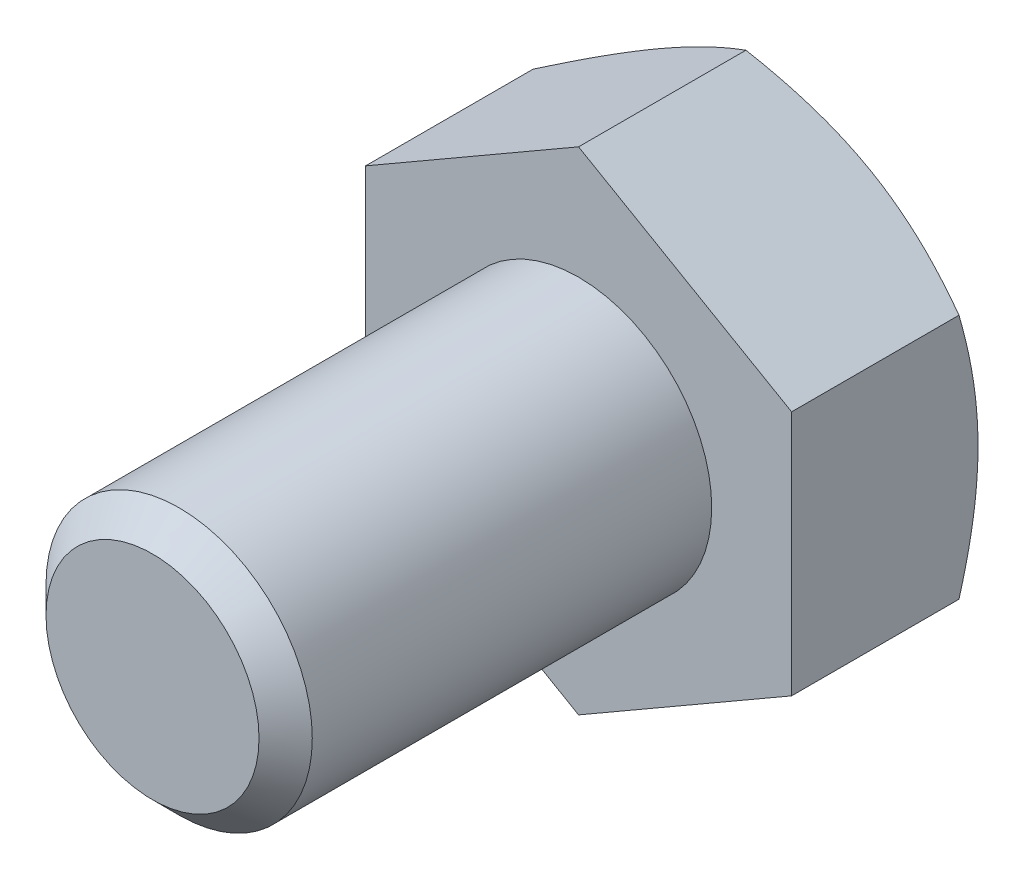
ISO-10303-21;
HEADER;
FILE_DESCRIPTION(('STEP AP214'),'2;1');
FILE_NAME('part.step','',(''),(''),'','','');
FILE_SCHEMA(('AUTOMOTIVE_DESIGN { 1 0 10303 214 1 1 1 1 }'));
ENDSEC;
DATA;
#1=APPLICATION_CONTEXT('core data for automotive mechanical design processes');
#2=APPLICATION_PROTOCOL_DEFINITION('international standard','automotive_design',2000,#1);
#3=PRODUCT_CONTEXT('',#1,'mechanical');
#4=PRODUCT('Part','Part','',(#3));
#5=PRODUCT_RELATED_PRODUCT_CATEGORY('part','',(#4));
#6=PRODUCT_DEFINITION_FORMATION('','',#4);
#7=PRODUCT_DEFINITION_CONTEXT('part definition',#1,'design');
#8=PRODUCT_DEFINITION('design','',#6,#7);
#9=PRODUCT_DEFINITION_SHAPE('','',#8);
#10=(LENGTH_UNIT() NAMED_UNIT(*) SI_UNIT(.MILLI.,.METRE.));
#11=(NAMED_UNIT(*) PLANE_ANGLE_UNIT() SI_UNIT($,.RADIAN.));
#12=(NAMED_UNIT(*) SI_UNIT($,.STERADIAN.) SOLID_ANGLE_UNIT());
#13=UNCERTAINTY_MEASURE_WITH_UNIT(LENGTH_MEASURE(1.E-05),#10,'distance_accuracy_value','');
#14=(GEOMETRIC_REPRESENTATION_CONTEXT(3) GLOBAL_UNCERTAINTY_ASSIGNED_CONTEXT((#13)) GLOBAL_UNIT_ASSIGNED_CONTEXT((#10,
#11,#12)) REPRESENTATION_CONTEXT('',''));
#15=CARTESIAN_POINT('',(0.,0.,0.));
#16=DIRECTION('',(0.,0.,1.));
#17=DIRECTION('',(1.,0.,0.));
#18=AXIS2_PLACEMENT_3D('',#15,#16,#17);
#19=CARTESIAN_POINT('',(0.,0.,8.));
#20=DIRECTION('',(0.,0.,1.));
#21=DIRECTION('',(1.,0.,0.));
#22=AXIS2_PLACEMENT_3D('',#19,#20,#21);
#23=PLANE('',#22);
#24=CARTESIAN_POINT('',(0.,0.,8.));
#25=DIRECTION('',(0.,0.,1.));
#26=DIRECTION('',(1.,0.,0.));
#27=AXIS2_PLACEMENT_3D('',#24,#25,#26);
#28=CIRCLE('',#27,2.);
#29=CARTESIAN_POINT('',(2.,0.,8.));
#30=VERTEX_POINT('',#29);
#31=EDGE_CURVE('E542',#30,#30,#28,.T.);
#32=ORIENTED_EDGE('',*,*,#31,.T.);
#33=EDGE_LOOP('',(#32));
#34=FACE_BOUND('',#33,.T.);
#35=ADVANCED_FACE('F368',(#34),#23,.T.);
#36=CARTESIAN_POINT('',(0.,0.,0.));
#37=DIRECTION('',(0.,0.,1.));
#38=DIRECTION('',(1.,0.,0.));
#39=AXIS2_PLACEMENT_3D('',#36,#37,#38);
#40=CYLINDRICAL_SURFACE('',#39,2.5);
#41=CARTESIAN_POINT('',(0.,0.,7.5));
#42=DIRECTION('',(0.,0.,1.));
#43=DIRECTION('',(1.,0.,0.));
#44=AXIS2_PLACEMENT_3D('',#41,#42,#43);
#45=CIRCLE('',#44,2.5);
#46=CARTESIAN_POINT('',(2.5,0.,7.5));
#47=VERTEX_POINT('',#46);
#48=EDGE_CURVE('E544',#47,#47,#45,.F.);
#49=ORIENTED_EDGE('',*,*,#48,.T.);
#50=EDGE_LOOP('',(#49));
#51=FACE_BOUND('',#50,.T.);
#52=CARTESIAN_POINT('',(0.,0.,0.));
#53=DIRECTION('',(0.,0.,1.));
#54=DIRECTION('',(1.,0.,0.));
#55=AXIS2_PLACEMENT_3D('',#52,#53,#54);
#56=CIRCLE('',#55,2.5);
#57=CARTESIAN_POINT('',(2.5,0.,0.));
#58=VERTEX_POINT('',#57);
#59=EDGE_CURVE('E545',#58,#58,#56,.F.);
#60=ORIENTED_EDGE('',*,*,#59,.F.);
#61=EDGE_LOOP('',(#60));
#62=FACE_BOUND('',#61,.T.);
#63=ADVANCED_FACE('F533',(#51,#62),#40,.T.);
#64=CARTESIAN_POINT('',(0.,0.,8.));
#65=DIRECTION('',(0.,0.,-1.));
#66=DIRECTION('',(-1.,0.,0.));
#67=AXIS2_PLACEMENT_3D('',#64,#65,#66);
#68=CONICAL_SURFACE('',#67,2.,0.785398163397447);
#69=ORIENTED_EDGE('',*,*,#48,.F.);
#70=EDGE_LOOP('',(#69));
#71=FACE_BOUND('',#70,.T.);
#72=ORIENTED_EDGE('',*,*,#31,.F.);
#73=EDGE_LOOP('',(#72));
#74=FACE_BOUND('',#73,.T.);
#75=ADVANCED_FACE('F538',(#71,#74),#68,.T.);
#76=CARTESIAN_POINT('',(0.,4.61880215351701,-3.5));
#77=DIRECTION('',(0.499999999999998,0.86602540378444,0.));
#78=DIRECTION('',(-0.86602540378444,0.499999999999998,0.));
#79=AXIS2_PLACEMENT_3D('',#76,#77,#78);
#80=PLANE('',#79);
#81=CARTESIAN_POINT('',(-0.000200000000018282,4.61891762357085,-3.14266774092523));
#82=CARTESIAN_POINT('',(0.17557915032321,4.51743148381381,-3.20128212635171));
#83=CARTESIAN_POINT('',(0.352875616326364,4.41506932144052,-3.25458967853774));
#84=CARTESIAN_POINT('',(0.710538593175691,4.2085725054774,-3.3476383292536));
#85=CARTESIAN_POINT('',(0.890911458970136,4.10443418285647,-3.3873465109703));
#86=CARTESIAN_POINT('',(1.24942181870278,3.89744813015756,-3.44915778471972));
#87=CARTESIAN_POINT('',(1.42750415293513,3.7946322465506,-3.47167226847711));
#88=CARTESIAN_POINT('',(1.7845067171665,3.58851671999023,-3.49854937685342));
#89=CARTESIAN_POINT('',(1.96342564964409,3.48521782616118,-3.50293425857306));
#90=CARTESIAN_POINT('',(2.29774284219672,3.29219970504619,-3.49380992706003));
#91=CARTESIAN_POINT('',(2.45319115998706,3.20245157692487,-3.48254104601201));
#92=CARTESIAN_POINT('',(2.76307505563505,3.02354002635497,-3.44682600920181));
#93=CARTESIAN_POINT('',(2.91750956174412,2.93437722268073,-3.42236765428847));
#94=CARTESIAN_POINT('',(3.22803232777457,2.75509682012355,-3.36122393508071));
#95=CARTESIAN_POINT('',(3.3840812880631,2.66500191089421,-3.32427939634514));
#96=CARTESIAN_POINT('',(3.69385183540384,2.48615580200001,-3.24042992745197));
#97=CARTESIAN_POINT('',(3.84757739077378,2.39740231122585,-3.19354469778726));
#98=CARTESIAN_POINT('',(4.0002,2.30928560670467,-3.14266774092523));
#99=B_SPLINE_CURVE_WITH_KNOTS('',3,(#81,#82,#83,#84,#85,#86,#87,#88,#89,#90,#91,#92,#93,#94,#95,
#96,#97,#98),.UNSPECIFIED.,.F.,.F.,(4,2,2,2,2,2,2,2,4),(0.,0.634047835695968,1.26961969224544,
1.88946157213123,2.50854226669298,3.04757825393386,3.58711366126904,4.13861653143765,
4.68903648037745),.UNSPECIFIED.);
#100=CARTESIAN_POINT('',(0.,4.61880215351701,-3.14273441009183));
#101=VERTEX_POINT('',#100);
#102=CARTESIAN_POINT('',(1.99999999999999,3.46410161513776,-3.5));
#103=VERTEX_POINT('',#102);
#104=EDGE_CURVE('E578',#101,#103,#99,.T.);
#105=ORIENTED_EDGE('',*,*,#104,.F.);
#106=DIRECTION('',(0.,0.,1.));
#107=VECTOR('',#106,1.);
#108=CARTESIAN_POINT('',(0.,4.61880215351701,-3.5));
#109=LINE('',#108,#107);
#110=CARTESIAN_POINT('',(0.,4.61880215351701,0.));
#111=VERTEX_POINT('',#110);
#112=EDGE_CURVE('E552',#101,#111,#109,.T.);
#113=ORIENTED_EDGE('',*,*,#112,.T.);
#114=DIRECTION('',(-0.86602540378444,0.499999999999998,0.));
#115=VECTOR('',#114,1.);
#116=CARTESIAN_POINT('',(0.,4.61880215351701,0.));
#117=LINE('',#116,#115);
#118=CARTESIAN_POINT('',(4.,2.30940107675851,0.));
#119=VERTEX_POINT('',#118);
#120=EDGE_CURVE('E576',#119,#111,#117,.T.);
#121=ORIENTED_EDGE('',*,*,#120,.F.);
#122=DIRECTION('',(0.,0.,1.));
#123=VECTOR('',#122,1.);
#124=CARTESIAN_POINT('',(4.,2.30940107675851,-3.5));
#125=LINE('',#124,#123);
#126=CARTESIAN_POINT('',(4.,2.30940107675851,-3.14273441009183));
#127=VERTEX_POINT('',#126);
#128=EDGE_CURVE('E549',#127,#119,#125,.T.);
#129=ORIENTED_EDGE('',*,*,#128,.F.);
#130=EDGE_CURVE('E508',#103,#127,#99,.T.);
#131=ORIENTED_EDGE('',*,*,#130,.F.);
#132=EDGE_LOOP('',(#105,#113,#121,#129,#131));
#133=FACE_BOUND('',#132,.T.);
#134=ADVANCED_FACE('F518',(#133),#80,.T.);
#135=CARTESIAN_POINT('',(4.,-2.30940107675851,-3.5));
#136=DIRECTION('',(1.,0.,0.));
#137=DIRECTION('',(0.,0.,-1.));
#138=AXIS2_PLACEMENT_3D('',#135,#136,#137);
#139=PLANE('',#138);
#140=CARTESIAN_POINT('',(4.,-6.3201620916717,-1.49105074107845));
#141=CARTESIAN_POINT('',(4.,-6.14442149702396,-1.57676392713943));
#142=CARTESIAN_POINT('',(4.,-5.96828976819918,-1.66168830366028));
#143=CARTESIAN_POINT('',(4.,-5.61503642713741,-1.82951794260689));
#144=CARTESIAN_POINT('',(4.,-5.43791467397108,-1.91242290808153));
#145=CARTESIAN_POINT('',(4.,-5.08161610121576,-2.07616457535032));
#146=CARTESIAN_POINT('',(4.,-4.90243340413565,-2.15698853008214));
#147=CARTESIAN_POINT('',(4.,-4.54268290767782,-2.31548071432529));
#148=CARTESIAN_POINT('',(4.,-4.36211517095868,-2.3931490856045));
#149=CARTESIAN_POINT('',(4.,-3.99309046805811,-2.54709429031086));
#150=CARTESIAN_POINT('',(4.,-3.80457523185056,-2.62323217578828));
#151=CARTESIAN_POINT('',(4.,-3.42538286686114,-2.77002330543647));
#152=CARTESIAN_POINT('',(4.,-3.23470550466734,-2.84067595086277));
#153=CARTESIAN_POINT('',(4.,-2.85120603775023,-2.9747272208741));
#154=CARTESIAN_POINT('',(4.,-2.65838877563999,-3.03813956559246));
#155=CARTESIAN_POINT('',(4.,-2.26999073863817,-3.15575322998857));
#156=CARTESIAN_POINT('',(4.,-2.07441081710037,-3.2099573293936));
#157=CARTESIAN_POINT('',(4.,-1.68146389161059,-3.30634238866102));
#158=CARTESIAN_POINT('',(4.,-1.48411388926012,-3.34859141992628));
#159=CARTESIAN_POINT('',(4.,-1.08684206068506,-3.41875684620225));
#160=CARTESIAN_POINT('',(4.,-0.886920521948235,-3.44667482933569));
#161=CARTESIAN_POINT('',(4.,-0.488161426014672,-3.48559194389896));
#162=CARTESIAN_POINT('',(4.,-0.289346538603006,-3.49681761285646));
#163=CARTESIAN_POINT('',(4.,0.108530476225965,-3.5020027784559));
#164=CARTESIAN_POINT('',(4.,0.307592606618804,-3.49596206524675));
#165=CARTESIAN_POINT('',(4.,0.642130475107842,-3.47173841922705));
#166=CARTESIAN_POINT('',(4.,0.777947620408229,-3.45796321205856));
#167=CARTESIAN_POINT('',(4.,1.04865722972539,-3.42317125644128));
#168=CARTESIAN_POINT('',(4.,1.18354957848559,-3.4021536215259));
#169=CARTESIAN_POINT('',(4.,1.58661718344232,-3.32933470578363));
#170=CARTESIAN_POINT('',(4.,1.85305348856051,-3.2677780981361));
#171=CARTESIAN_POINT('',(4.,2.25169312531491,-3.16013293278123));
#172=CARTESIAN_POINT('',(4.,2.38593642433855,-3.12116080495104));
#173=CARTESIAN_POINT('',(4.,2.65312122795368,-3.03894486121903));
#174=CARTESIAN_POINT('',(4.,2.78606272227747,-2.99570101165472));
#175=CARTESIAN_POINT('',(4.,3.05068341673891,-2.90565399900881));
#176=CARTESIAN_POINT('',(4.,3.18236294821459,-2.8588518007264));
#177=CARTESIAN_POINT('',(4.,3.44461473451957,-2.76226098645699));
#178=CARTESIAN_POINT('',(4.,3.57518701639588,-2.71247244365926));
#179=CARTESIAN_POINT('',(4.,3.93177798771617,-2.57257226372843));
#180=CARTESIAN_POINT('',(4.,4.15680215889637,-2.47992787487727));
#181=CARTESIAN_POINT('',(4.,4.60447894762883,-2.28905562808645));
#182=CARTESIAN_POINT('',(4.,4.82713127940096,-2.19082710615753));
#183=CARTESIAN_POINT('',(4.,5.27061186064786,-1.99013448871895));
#184=CARTESIAN_POINT('',(4.,5.49143940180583,-1.88766883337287));
#185=CARTESIAN_POINT('',(4.,5.93157734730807,-1.67952247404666));
#186=CARTESIAN_POINT('',(4.,6.15088770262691,-1.57384166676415));
#187=CARTESIAN_POINT('',(4.,6.58864452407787,-1.35980684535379));
#188=CARTESIAN_POINT('',(4.,6.80708897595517,-1.25144872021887));
#189=CARTESIAN_POINT('',(4.,7.24298360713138,-1.03274864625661));
#190=CARTESIAN_POINT('',(4.,7.46043377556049,-0.922406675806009));
#191=CARTESIAN_POINT('',(4.,8.11147090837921,-0.589073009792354));
#192=CARTESIAN_POINT('',(4.,8.5438492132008,-0.363721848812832));
#193=CARTESIAN_POINT('',(4.,9.35956992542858,0.0664624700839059));
#194=CARTESIAN_POINT('',(4.,9.74313951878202,0.270866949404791));
#195=CARTESIAN_POINT('',(4.,10.5090013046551,0.68211422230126));
#196=CARTESIAN_POINT('',(4.,10.891293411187,0.888957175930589));
#197=CARTESIAN_POINT('',(4.,11.6535663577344,1.30371780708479));
#198=CARTESIAN_POINT('',(4.,12.0335506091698,1.51162922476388));
#199=CARTESIAN_POINT('',(4.,12.7927224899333,1.928827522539));
#200=CARTESIAN_POINT('',(4.,13.1719101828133,2.13811428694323));
#201=CARTESIAN_POINT('',(4.,13.5508195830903,2.34790058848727));
#202=B_SPLINE_CURVE_WITH_KNOTS('',3,(#140,#141,#142,#143,#144,#145,#146,#147,#148,#149,#150,
#151,#152,#153,#154,#155,#156,#157,#158,#159,#160,#161,#162,#163,#164,#165,#166,#167,#168,#169,
#170,#171,#172,#173,#174,#175,#176,#177,#178,#179,#180,#181,#182,#183,#184,#185,#186,#187,#188,
#189,#190,#191,#192,#193,#194,#195,#196,#197,#198,#199,#200,#201),.UNSPECIFIED.,.F.,.F.,(4,2,2,
2,2,2,2,2,2,2,2,2,2,2,2,2,2,2,2,2,2,2,2,2,2,2,2,2,2,2,4),(0.,0.58659299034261,1.17327172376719,
1.76295108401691,2.35260392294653,2.96246799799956,3.57239854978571,4.18115341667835,
4.78972418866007,5.39475667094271,5.99972209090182,6.59639988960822,7.19308494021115,
7.60243041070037,8.01182600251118,8.83100524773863,9.25032401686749,9.66964609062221,
10.0888548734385,10.5080533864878,11.2379871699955,11.9680079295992,12.6982998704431,
13.4286153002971,14.1601319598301,14.8916565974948,16.354355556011,17.6582490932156,
18.9622286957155,20.261662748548,21.5609888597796),.UNSPECIFIED.);
#203=CARTESIAN_POINT('',(4.,0.,-3.5));
#204=VERTEX_POINT('',#203);
#205=EDGE_CURVE('E506',#127,#204,#202,.F.);
#206=ORIENTED_EDGE('',*,*,#205,.F.);
#207=ORIENTED_EDGE('',*,*,#128,.T.);
#208=DIRECTION('',(0.,1.,0.));
#209=VECTOR('',#208,1.);
#210=CARTESIAN_POINT('',(4.,-2.30940107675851,0.));
#211=LINE('',#210,#209);
#212=CARTESIAN_POINT('',(4.,-2.30940107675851,0.));
#213=VERTEX_POINT('',#212);
#214=EDGE_CURVE('E554',#213,#119,#211,.T.);
#215=ORIENTED_EDGE('',*,*,#214,.F.);
#216=DIRECTION('',(0.,0.,1.));
#217=VECTOR('',#216,1.);
#218=CARTESIAN_POINT('',(4.,-2.30940107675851,-3.5));
#219=LINE('',#218,#217);
#220=CARTESIAN_POINT('',(4.,-2.30940107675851,-3.14273441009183));
#221=VERTEX_POINT('',#220);
#222=EDGE_CURVE('E560',#221,#213,#219,.T.);
#223=ORIENTED_EDGE('',*,*,#222,.F.);
#224=EDGE_CURVE('E501',#204,#221,#202,.F.);
#225=ORIENTED_EDGE('',*,*,#224,.F.);
#226=EDGE_LOOP('',(#206,#207,#215,#223,#225));
#227=FACE_BOUND('',#226,.T.);
#228=ADVANCED_FACE('F514',(#227),#139,.T.);
#229=CARTESIAN_POINT('',(0.,-4.61880215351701,-3.5));
#230=DIRECTION('',(0.499999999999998,-0.86602540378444,0.));
#231=DIRECTION('',(0.86602540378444,0.499999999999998,0.));
#232=AXIS2_PLACEMENT_3D('',#229,#230,#231);
#233=PLANE('',#232);
#234=CARTESIAN_POINT('',(4.0002,-2.30928560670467,-3.14266774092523));
#235=CARTESIAN_POINT('',(3.82442084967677,-2.41077174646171,-3.20128212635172));
#236=CARTESIAN_POINT('',(3.64712438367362,-2.513133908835,-3.25458967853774));
#237=CARTESIAN_POINT('',(3.28946140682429,-2.71963072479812,-3.3476383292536));
#238=CARTESIAN_POINT('',(3.10908854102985,-2.82376904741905,-3.3873465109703));
#239=CARTESIAN_POINT('',(2.75057818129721,-3.03075510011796,-3.44915778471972));
#240=CARTESIAN_POINT('',(2.57249584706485,-3.13357098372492,-3.47167226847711));
#241=CARTESIAN_POINT('',(2.21549328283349,-3.33968651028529,-3.49854937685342));
#242=CARTESIAN_POINT('',(2.03657435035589,-3.44298540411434,-3.50293425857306));
#243=CARTESIAN_POINT('',(1.70225715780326,-3.63600352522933,-3.49380992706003));
#244=CARTESIAN_POINT('',(1.54680884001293,-3.72575165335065,-3.48254104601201));
#245=CARTESIAN_POINT('',(1.23692494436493,-3.90466320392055,-3.44682600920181));
#246=CARTESIAN_POINT('',(1.08249043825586,-3.99382600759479,-3.42236765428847));
#247=CARTESIAN_POINT('',(0.771967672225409,-4.17310641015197,-3.36122393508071));
#248=CARTESIAN_POINT('',(0.615918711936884,-4.26320131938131,-3.32427939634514));
#249=CARTESIAN_POINT('',(0.306148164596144,-4.44204742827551,-3.24042992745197));
#250=CARTESIAN_POINT('',(0.152422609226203,-4.53080091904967,-3.19354469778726));
#251=CARTESIAN_POINT('',(-0.000200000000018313,-4.61891762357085,-3.14266774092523));
#252=B_SPLINE_CURVE_WITH_KNOTS('',3,(#234,#235,#236,#237,#238,#239,#240,#241,#242,#243,#244,
#245,#246,#247,#248,#249,#250,#251),.UNSPECIFIED.,.F.,.F.,(4,2,2,2,2,2,2,2,4),(0.,
0.634047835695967,1.26961969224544,1.88946157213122,2.50854226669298,3.04757825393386,
3.58711366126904,4.13861653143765,4.68903648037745),.UNSPECIFIED.);
#253=CARTESIAN_POINT('',(1.99999999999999,-3.46410161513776,-3.5));
#254=VERTEX_POINT('',#253);
#255=EDGE_CURVE('E507',#221,#254,#252,.T.);
#256=ORIENTED_EDGE('',*,*,#255,.F.);
#257=ORIENTED_EDGE('',*,*,#222,.T.);
#258=DIRECTION('',(0.86602540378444,0.499999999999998,0.));
#259=VECTOR('',#258,1.);
#260=CARTESIAN_POINT('',(0.,-4.61880215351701,0.));
#261=LINE('',#260,#259);
#262=CARTESIAN_POINT('',(0.,-4.61880215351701,0.));
#263=VERTEX_POINT('',#262);
#264=EDGE_CURVE('E565',#263,#213,#261,.T.);
#265=ORIENTED_EDGE('',*,*,#264,.F.);
#266=DIRECTION('',(0.,0.,1.));
#267=VECTOR('',#266,1.);
#268=CARTESIAN_POINT('',(0.,-4.61880215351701,-3.5));
#269=LINE('',#268,#267);
#270=CARTESIAN_POINT('',(0.,-4.61880215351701,-3.14273441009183));
#271=VERTEX_POINT('',#270);
#272=EDGE_CURVE('E558',#271,#263,#269,.T.);
#273=ORIENTED_EDGE('',*,*,#272,.F.);
#274=EDGE_CURVE('E495',#254,#271,#252,.T.);
#275=ORIENTED_EDGE('',*,*,#274,.F.);
#276=EDGE_LOOP('',(#256,#257,#265,#273,#275));
#277=FACE_BOUND('',#276,.T.);
#278=ADVANCED_FACE('F517',(#277),#233,.T.);
#279=CARTESIAN_POINT('',(0.,-4.61880215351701,-3.5));
#280=DIRECTION('',(-0.500000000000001,-0.866025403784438,0.));
#281=DIRECTION('',(0.866025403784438,-0.500000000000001,0.));
#282=AXIS2_PLACEMENT_3D('',#279,#280,#281);
#283=PLANE('',#282);
#284=CARTESIAN_POINT('',(0.000199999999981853,-4.61891762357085,-3.14266774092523));
#285=CARTESIAN_POINT('',(-0.175579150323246,-4.51743148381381,-3.20128212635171));
#286=CARTESIAN_POINT('',(-0.352875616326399,-4.41506932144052,-3.25458967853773));
#287=CARTESIAN_POINT('',(-0.710538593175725,-4.2085725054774,-3.34763832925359));
#288=CARTESIAN_POINT('',(-0.89091145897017,-4.10443418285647,-3.38734651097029));
#289=CARTESIAN_POINT('',(-1.24942181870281,-3.89744813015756,-3.44915778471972));
#290=CARTESIAN_POINT('',(-1.42750415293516,-3.79463224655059,-3.47167226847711));
#291=CARTESIAN_POINT('',(-1.78450671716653,-3.58851671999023,-3.49854937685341));
#292=CARTESIAN_POINT('',(-1.96342564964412,-3.48521782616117,-3.50293425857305));
#293=CARTESIAN_POINT('',(-2.29774284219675,-3.29219970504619,-3.49380992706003));
#294=CARTESIAN_POINT('',(-2.45319115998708,-3.20245157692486,-3.482541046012));
#295=CARTESIAN_POINT('',(-2.76307505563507,-3.02354002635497,-3.4468260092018));
#296=CARTESIAN_POINT('',(-2.91750956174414,-2.93437722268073,-3.42236765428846));
#297=CARTESIAN_POINT('',(-3.22803232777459,-2.75509682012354,-3.36122393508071));
#298=CARTESIAN_POINT('',(-3.38408128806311,-2.6650019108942,-3.32427939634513));
#299=CARTESIAN_POINT('',(-3.69385183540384,-2.48615580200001,-3.24042992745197));
#300=CARTESIAN_POINT('',(-3.84757739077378,-2.39740231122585,-3.19354469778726));
#301=CARTESIAN_POINT('',(-4.0002,-2.30928560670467,-3.14266774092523));
#302=B_SPLINE_CURVE_WITH_KNOTS('',3,(#284,#285,#286,#287,#288,#289,#290,#291,#292,#293,#294,
#295,#296,#297,#298,#299,#300,#301),.UNSPECIFIED.,.F.,.F.,(4,2,2,2,2,2,2,2,4),(0.,
0.634047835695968,1.26961969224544,1.88946157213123,2.50854226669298,3.04757825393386,
3.58711366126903,4.13861653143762,4.68903648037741),.UNSPECIFIED.);
#303=CARTESIAN_POINT('',(-2.,-3.46410161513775,-3.5));
#304=VERTEX_POINT('',#303);
#305=EDGE_CURVE('E597',#271,#304,#302,.T.);
#306=ORIENTED_EDGE('',*,*,#305,.F.);
#307=ORIENTED_EDGE('',*,*,#272,.T.);
#308=DIRECTION('',(0.866025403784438,-0.500000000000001,0.));
#309=VECTOR('',#308,1.);
#310=CARTESIAN_POINT('',(0.,-4.61880215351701,0.));
#311=LINE('',#310,#309);
#312=CARTESIAN_POINT('',(-4.,-2.30940107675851,0.));
#313=VERTEX_POINT('',#312);
#314=EDGE_CURVE('E568',#313,#263,#311,.T.);
#315=ORIENTED_EDGE('',*,*,#314,.F.);
#316=DIRECTION('',(0.,0.,1.));
#317=VECTOR('',#316,1.);
#318=CARTESIAN_POINT('',(-4.,-2.30940107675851,-3.5));
#319=LINE('',#318,#317);
#320=CARTESIAN_POINT('',(-4.,-2.30940107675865,-3.14273441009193));
#321=VERTEX_POINT('',#320);
#322=EDGE_CURVE('E556',#321,#313,#319,.T.);
#323=ORIENTED_EDGE('',*,*,#322,.F.);
#324=EDGE_CURVE('E444',#304,#321,#302,.T.);
#325=ORIENTED_EDGE('',*,*,#324,.F.);
#326=EDGE_LOOP('',(#306,#307,#315,#323,#325));
#327=FACE_BOUND('',#326,.T.);
#328=ADVANCED_FACE('F522',(#327),#283,.T.);
#329=CARTESIAN_POINT('',(-4.,-2.30940107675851,-3.5));
#330=DIRECTION('',(-1.,0.,0.));
#331=DIRECTION('',(0.,0.,1.));
#332=AXIS2_PLACEMENT_3D('',#329,#330,#331);
#333=PLANE('',#332);
#334=CARTESIAN_POINT('',(-4.,-6.3201620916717,-1.49105074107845));
#335=CARTESIAN_POINT('',(-4.,-6.14442149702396,-1.57676392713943));
#336=CARTESIAN_POINT('',(-4.,-5.96828976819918,-1.66168830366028));
#337=CARTESIAN_POINT('',(-4.,-5.61503642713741,-1.82951794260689));
#338=CARTESIAN_POINT('',(-4.,-5.43791467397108,-1.91242290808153));
#339=CARTESIAN_POINT('',(-4.,-5.08161610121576,-2.07616457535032));
#340=CARTESIAN_POINT('',(-4.,-4.90243340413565,-2.15698853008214));
#341=CARTESIAN_POINT('',(-4.,-4.54268290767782,-2.31548071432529));
#342=CARTESIAN_POINT('',(-4.,-4.36211517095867,-2.3931490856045));
#343=CARTESIAN_POINT('',(-4.,-3.99309046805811,-2.54709429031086));
#344=CARTESIAN_POINT('',(-4.,-3.80457523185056,-2.62323217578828));
#345=CARTESIAN_POINT('',(-4.,-3.42538286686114,-2.77002330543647));
#346=CARTESIAN_POINT('',(-4.,-3.23470550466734,-2.84067595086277));
#347=CARTESIAN_POINT('',(-4.,-2.85120603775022,-2.9747272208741));
#348=CARTESIAN_POINT('',(-4.,-2.65838877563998,-3.03813956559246));
#349=CARTESIAN_POINT('',(-4.,-2.26999073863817,-3.15575322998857));
#350=CARTESIAN_POINT('',(-4.,-2.07441081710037,-3.2099573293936));
#351=CARTESIAN_POINT('',(-4.,-1.68146389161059,-3.30634238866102));
#352=CARTESIAN_POINT('',(-4.,-1.48411388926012,-3.34859141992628));
#353=CARTESIAN_POINT('',(-4.,-1.08684206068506,-3.41875684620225));
#354=CARTESIAN_POINT('',(-4.,-0.886920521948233,-3.44667482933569));
#355=CARTESIAN_POINT('',(-4.,-0.488161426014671,-3.48559194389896));
#356=CARTESIAN_POINT('',(-4.,-0.289346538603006,-3.49681761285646));
#357=CARTESIAN_POINT('',(-4.,0.108530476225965,-3.5020027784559));
#358=CARTESIAN_POINT('',(-4.,0.307592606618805,-3.49596206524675));
#359=CARTESIAN_POINT('',(-4.,0.642130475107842,-3.47173841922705));
#360=CARTESIAN_POINT('',(-4.,0.777947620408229,-3.45796321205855));
#361=CARTESIAN_POINT('',(-4.,1.04865722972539,-3.42317125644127));
#362=CARTESIAN_POINT('',(-4.,1.18354957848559,-3.4021536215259));
#363=CARTESIAN_POINT('',(-4.,1.58661718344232,-3.32933470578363));
#364=CARTESIAN_POINT('',(-4.,1.8530534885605,-3.2677780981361));
#365=CARTESIAN_POINT('',(-4.,2.2516931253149,-3.16013293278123));
#366=CARTESIAN_POINT('',(-4.,2.38593642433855,-3.12116080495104));
#367=CARTESIAN_POINT('',(-4.,2.65312122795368,-3.03894486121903));
#368=CARTESIAN_POINT('',(-4.,2.78606272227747,-2.99570101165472));
#369=CARTESIAN_POINT('',(-4.,3.05068341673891,-2.90565399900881));
#370=CARTESIAN_POINT('',(-4.,3.18236294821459,-2.8588518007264));
#371=CARTESIAN_POINT('',(-4.,3.44461473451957,-2.76226098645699));
#372=CARTESIAN_POINT('',(-4.,3.57518701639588,-2.71247244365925));
#373=CARTESIAN_POINT('',(-4.,3.93177798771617,-2.57257226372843));
#374=CARTESIAN_POINT('',(-4.,4.15680215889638,-2.47992787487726));
#375=CARTESIAN_POINT('',(-4.,4.60447894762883,-2.28905562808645));
#376=CARTESIAN_POINT('',(-4.,4.82713127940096,-2.19082710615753));
#377=CARTESIAN_POINT('',(-4.,5.27061186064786,-1.99013448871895));
#378=CARTESIAN_POINT('',(-4.,5.49143940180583,-1.88766883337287));
#379=CARTESIAN_POINT('',(-4.,5.93157734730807,-1.67952247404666));
#380=CARTESIAN_POINT('',(-4.,6.15088770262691,-1.57384166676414));
#381=CARTESIAN_POINT('',(-4.,6.58864452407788,-1.35980684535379));
#382=CARTESIAN_POINT('',(-4.,6.80708897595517,-1.25144872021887));
#383=CARTESIAN_POINT('',(-4.,7.24298360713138,-1.03274864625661));
#384=CARTESIAN_POINT('',(-4.,7.46043377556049,-0.922406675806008));
#385=CARTESIAN_POINT('',(-4.,8.11147090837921,-0.589073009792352));
#386=CARTESIAN_POINT('',(-4.,8.5438492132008,-0.363721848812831));
#387=CARTESIAN_POINT('',(-4.,9.35956992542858,0.066462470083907));
#388=CARTESIAN_POINT('',(-4.,9.74313951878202,0.270866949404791));
#389=CARTESIAN_POINT('',(-4.,10.5090013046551,0.68211422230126));
#390=CARTESIAN_POINT('',(-4.,10.891293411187,0.888957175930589));
#391=CARTESIAN_POINT('',(-4.,11.6535663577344,1.30371780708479));
#392=CARTESIAN_POINT('',(-4.,12.0335506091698,1.51162922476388));
#393=CARTESIAN_POINT('',(-4.,12.7927224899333,1.928827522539));
#394=CARTESIAN_POINT('',(-4.,13.1719101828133,2.13811428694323));
#395=CARTESIAN_POINT('',(-4.,13.5508195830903,2.34790058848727));
#396=B_SPLINE_CURVE_WITH_KNOTS('',3,(#334,#335,#336,#337,#338,#339,#340,#341,#342,#343,#344,
#345,#346,#347,#348,#349,#350,#351,#352,#353,#354,#355,#356,#357,#358,#359,#360,#361,#362,#363,
#364,#365,#366,#367,#368,#369,#370,#371,#372,#373,#374,#375,#376,#377,#378,#379,#380,#381,#382,
#383,#384,#385,#386,#387,#388,#389,#390,#391,#392,#393,#394,#395),.UNSPECIFIED.,.F.,.F.,(4,2,2,
2,2,2,2,2,2,2,2,2,2,2,2,2,2,2,2,2,2,2,2,2,2,2,2,2,2,2,4),(0.,0.586592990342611,1.17327172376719,
1.76295108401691,2.35260392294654,2.96246799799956,3.57239854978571,4.18115341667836,
4.78972418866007,5.39475667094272,5.99972209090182,6.59639988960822,7.19308494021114,
7.60243041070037,8.01182600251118,8.83100524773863,9.25032401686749,9.66964609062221,
10.0888548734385,10.5080533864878,11.2379871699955,11.9680079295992,12.6982998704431,
13.4286153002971,14.1601319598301,14.8916565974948,16.354355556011,17.6582490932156,
18.9622286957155,20.261662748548,21.5609888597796),.UNSPECIFIED.);
#397=CARTESIAN_POINT('',(-4.,0.,-3.5));
#398=VERTEX_POINT('',#397);
#399=EDGE_CURVE('E439',#321,#398,#396,.T.);
#400=ORIENTED_EDGE('',*,*,#399,.F.);
#401=ORIENTED_EDGE('',*,*,#322,.T.);
#402=DIRECTION('',(0.,-1.,0.));
#403=VECTOR('',#402,1.);
#404=CARTESIAN_POINT('',(-4.,-2.30940107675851,0.));
#405=LINE('',#404,#403);
#406=CARTESIAN_POINT('',(-4.,2.30940107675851,0.));
#407=VERTEX_POINT('',#406);
#408=EDGE_CURVE('E571',#407,#313,#405,.T.);
#409=ORIENTED_EDGE('',*,*,#408,.F.);
#410=DIRECTION('',(0.,0.,1.));
#411=VECTOR('',#410,1.);
#412=CARTESIAN_POINT('',(-4.,2.30940107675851,-3.5));
#413=LINE('',#412,#411);
#414=CARTESIAN_POINT('',(-4.,2.30940107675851,-3.14273441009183));
#415=VERTEX_POINT('',#414);
#416=EDGE_CURVE('E465',#415,#407,#413,.T.);
#417=ORIENTED_EDGE('',*,*,#416,.F.);
#418=EDGE_CURVE('E448',#398,#415,#396,.T.);
#419=ORIENTED_EDGE('',*,*,#418,.F.);
#420=EDGE_LOOP('',(#400,#401,#409,#417,#419));
#421=FACE_BOUND('',#420,.T.);
#422=ADVANCED_FACE('F463',(#421),#333,.T.);
#423=CARTESIAN_POINT('',(-4.,2.30940107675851,-3.5));
#424=DIRECTION('',(-0.500000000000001,0.866025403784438,0.));
#425=DIRECTION('',(-0.866025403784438,-0.500000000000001,0.));
#426=AXIS2_PLACEMENT_3D('',#423,#424,#425);
#427=PLANE('',#426);
#428=CARTESIAN_POINT('',(-4.0002,2.30928560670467,-3.14266774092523));
#429=CARTESIAN_POINT('',(-3.82442084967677,2.41077174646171,-3.20128212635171));
#430=CARTESIAN_POINT('',(-3.64712438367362,2.513133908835,-3.25458967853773));
#431=CARTESIAN_POINT('',(-3.28946140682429,2.71963072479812,-3.34763832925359));
#432=CARTESIAN_POINT('',(-3.10908854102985,2.82376904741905,-3.38734651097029));
#433=CARTESIAN_POINT('',(-2.75057818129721,3.03075510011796,-3.44915778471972));
#434=CARTESIAN_POINT('',(-2.57249584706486,3.13357098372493,-3.47167226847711));
#435=CARTESIAN_POINT('',(-2.21549328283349,3.33968651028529,-3.49854937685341));
#436=CARTESIAN_POINT('',(-2.0365743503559,3.44298540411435,-3.50293425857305));
#437=CARTESIAN_POINT('',(-1.70225715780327,3.63600352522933,-3.49380992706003));
#438=CARTESIAN_POINT('',(-1.54680884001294,3.72575165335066,-3.482541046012));
#439=CARTESIAN_POINT('',(-1.23692494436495,3.90466320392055,-3.4468260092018));
#440=CARTESIAN_POINT('',(-1.08249043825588,3.99382600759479,-3.42236765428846));
#441=CARTESIAN_POINT('',(-0.771967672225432,4.17310641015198,-3.36122393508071));
#442=CARTESIAN_POINT('',(-0.61591871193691,4.26320131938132,-3.32427939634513));
#443=CARTESIAN_POINT('',(-0.306148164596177,4.44204742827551,-3.24042992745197));
#444=CARTESIAN_POINT('',(-0.152422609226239,4.53080091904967,-3.19354469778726));
#445=CARTESIAN_POINT('',(0.000199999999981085,4.61891762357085,-3.14266774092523));
#446=B_SPLINE_CURVE_WITH_KNOTS('',3,(#428,#429,#430,#431,#432,#433,#434,#435,#436,#437,#438,
#439,#440,#441,#442,#443,#444,#445),.UNSPECIFIED.,.F.,.F.,(4,2,2,2,2,2,2,2,4),(0.,
0.634047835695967,1.26961969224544,1.88946157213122,2.50854226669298,3.04757825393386,
3.58711366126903,4.13861653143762,4.68903648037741),.UNSPECIFIED.);
#447=CARTESIAN_POINT('',(-2.00000000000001,3.46410161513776,-3.5));
#448=VERTEX_POINT('',#447);
#449=EDGE_CURVE('E454',#415,#448,#446,.T.);
#450=ORIENTED_EDGE('',*,*,#449,.F.);
#451=ORIENTED_EDGE('',*,*,#416,.T.);
#452=DIRECTION('',(-0.866025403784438,-0.500000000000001,0.));
#453=VECTOR('',#452,1.);
#454=CARTESIAN_POINT('',(-4.,2.30940107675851,0.));
#455=LINE('',#454,#453);
#456=EDGE_CURVE('E574',#111,#407,#455,.T.);
#457=ORIENTED_EDGE('',*,*,#456,.F.);
#458=ORIENTED_EDGE('',*,*,#112,.F.);
#459=EDGE_CURVE('E456',#448,#101,#446,.T.);
#460=ORIENTED_EDGE('',*,*,#459,.F.);
#461=EDGE_LOOP('',(#450,#451,#457,#458,#460));
#462=FACE_BOUND('',#461,.T.);
#463=ADVANCED_FACE('F530',(#462),#427,.T.);
#464=CARTESIAN_POINT('',(4.,2.30940107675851,0.));
#465=DIRECTION('',(0.,0.,1.));
#466=DIRECTION('',(1.,0.,0.));
#467=AXIS2_PLACEMENT_3D('',#464,#465,#466);
#468=PLANE('',#467);
#469=ORIENTED_EDGE('',*,*,#59,.T.);
#470=EDGE_LOOP('',(#469));
#471=FACE_BOUND('',#470,.T.);
#472=ORIENTED_EDGE('',*,*,#120,.T.);
#473=ORIENTED_EDGE('',*,*,#456,.T.);
#474=ORIENTED_EDGE('',*,*,#408,.T.);
#475=ORIENTED_EDGE('',*,*,#314,.T.);
#476=ORIENTED_EDGE('',*,*,#264,.T.);
#477=ORIENTED_EDGE('',*,*,#214,.T.);
#478=EDGE_LOOP('',(#472,#473,#474,#475,#476,#477));
#479=FACE_BOUND('',#478,.T.);
#480=ADVANCED_FACE('F487',(#471,#479),#468,.T.);
#481=CARTESIAN_POINT('',(0.,0.,0.));
#482=DIRECTION('',(0.,0.,1.));
#483=DIRECTION('',(1.,0.,0.));
#484=AXIS2_PLACEMENT_3D('',#481,#482,#483);
#485=CONICAL_SURFACE('',#484,10.062177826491,1.0471975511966);
#486=ORIENTED_EDGE('',*,*,#130,.T.);
#487=ORIENTED_EDGE('',*,*,#205,.T.);
#488=CARTESIAN_POINT('',(0.,0.,-3.5));
#489=DIRECTION('',(0.,0.,1.));
#490=DIRECTION('',(1.,0.,0.));
#491=AXIS2_PLACEMENT_3D('',#488,#489,#490);
#492=CIRCLE('',#491,4.);
#493=EDGE_CURVE('E371',#103,#204,#492,.F.);
#494=ORIENTED_EDGE('',*,*,#493,.F.);
#495=EDGE_LOOP('',(#486,#487,#494));
#496=FACE_BOUND('',#495,.T.);
#497=ADVANCED_FACE('F587',(#496),#485,.T.);
#498=ORIENTED_EDGE('',*,*,#104,.T.);
#499=EDGE_CURVE('E461',#448,#103,#492,.F.);
#500=ORIENTED_EDGE('',*,*,#499,.F.);
#501=ORIENTED_EDGE('',*,*,#459,.T.);
#502=EDGE_LOOP('',(#498,#500,#501));
#503=FACE_BOUND('',#502,.T.);
#504=ADVANCED_FACE('F486',(#503),#485,.T.);
#505=ORIENTED_EDGE('',*,*,#418,.T.);
#506=ORIENTED_EDGE('',*,*,#449,.T.);
#507=CARTESIAN_POINT('',(0.,0.,-3.5));
#508=DIRECTION('',(0.,0.,-1.));
#509=DIRECTION('',(-1.,0.,0.));
#510=AXIS2_PLACEMENT_3D('',#507,#508,#509);
#511=CIRCLE('',#510,4.);
#512=EDGE_CURVE('E389',#398,#448,#511,.T.);
#513=ORIENTED_EDGE('',*,*,#512,.F.);
#514=EDGE_LOOP('',(#505,#506,#513));
#515=FACE_BOUND('',#514,.T.);
#516=ADVANCED_FACE('F452',(#515),#485,.T.);
#517=ORIENTED_EDGE('',*,*,#324,.T.);
#518=ORIENTED_EDGE('',*,*,#399,.T.);
#519=EDGE_CURVE('E441',#304,#398,#492,.F.);
#520=ORIENTED_EDGE('',*,*,#519,.F.);
#521=EDGE_LOOP('',(#517,#518,#520));
#522=FACE_BOUND('',#521,.T.);
#523=ADVANCED_FACE('F440',(#522),#485,.T.);
#524=ORIENTED_EDGE('',*,*,#274,.T.);
#525=ORIENTED_EDGE('',*,*,#305,.T.);
#526=EDGE_CURVE('E376',#254,#304,#492,.F.);
#527=ORIENTED_EDGE('',*,*,#526,.F.);
#528=EDGE_LOOP('',(#524,#525,#527));
#529=FACE_BOUND('',#528,.T.);
#530=ADVANCED_FACE('F599',(#529),#485,.T.);
#531=ORIENTED_EDGE('',*,*,#224,.T.);
#532=ORIENTED_EDGE('',*,*,#255,.T.);
#533=EDGE_CURVE('E11',#204,#254,#492,.F.);
#534=ORIENTED_EDGE('',*,*,#533,.F.);
#535=EDGE_LOOP('',(#531,#532,#534));
#536=FACE_BOUND('',#535,.T.);
#537=ADVANCED_FACE('F594',(#536),#485,.T.);
#538=CARTESIAN_POINT('',(4.,2.30940107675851,-3.5));
#539=DIRECTION('',(0.,0.,1.));
#540=DIRECTION('',(1.,0.,0.));
#541=AXIS2_PLACEMENT_3D('',#538,#539,#540);
#542=PLANE('',#541);
#543=ORIENTED_EDGE('',*,*,#493,.T.);
#544=ORIENTED_EDGE('',*,*,#533,.T.);
#545=ORIENTED_EDGE('',*,*,#526,.T.);
#546=ORIENTED_EDGE('',*,*,#519,.T.);
#547=ORIENTED_EDGE('',*,*,#512,.T.);
#548=ORIENTED_EDGE('',*,*,#499,.T.);
#549=EDGE_LOOP('',(#543,#544,#545,#546,#547,#548));
#550=FACE_BOUND('',#549,.T.);
#551=ADVANCED_FACE('F459',(#550),#542,.F.);
#552=CLOSED_SHELL('',(#35,#63,#75,#134,#228,#278,#328,#422,#463,#480,#497,#504,#516,#523,#530,
#537,#551));
#553=MANIFOLD_SOLID_BREP('B2',#552);
#554=ADVANCED_BREP_SHAPE_REPRESENTATION('',(#18,#553),#14);
#555=SHAPE_DEFINITION_REPRESENTATION(#9,#554);
ENDSEC;
END-ISO-10303-21;
